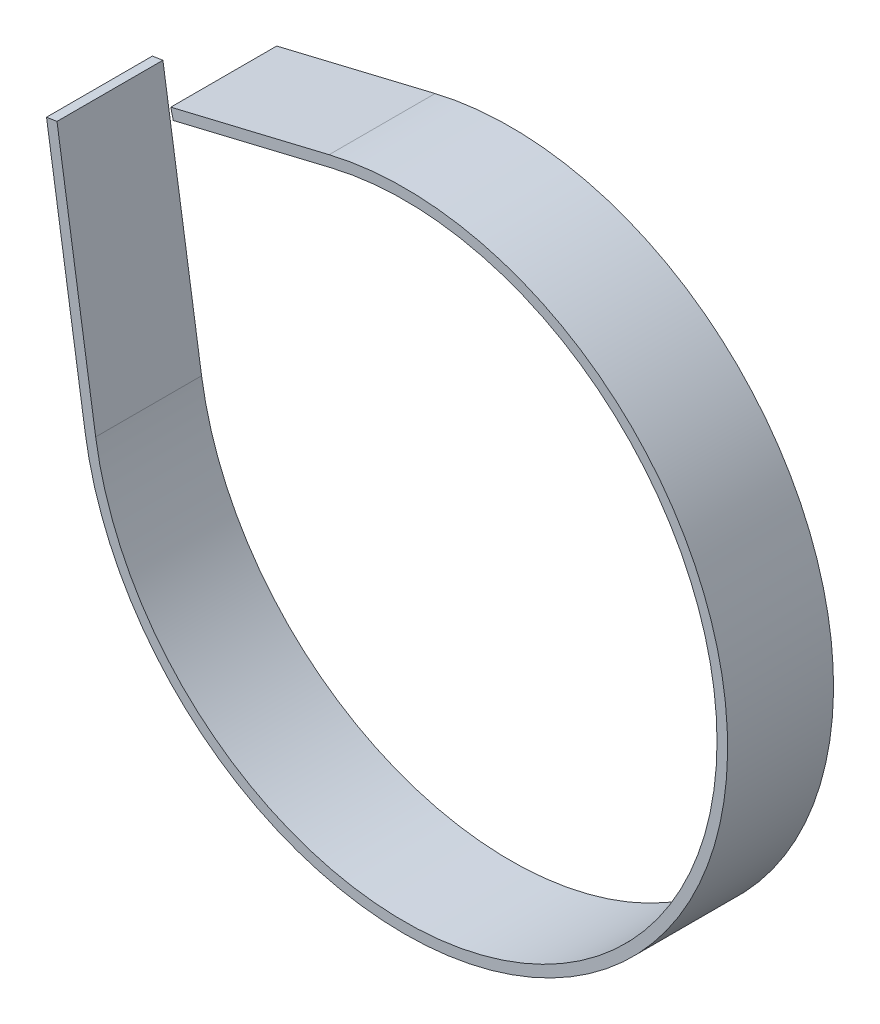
from build123d import *

# Parameters (mm, degrees)
EXTRUSION1_DEPTH = 80


with BuildPart() as part:
    # Esquisse1 → Extrusion1 (new body)
    with BuildSketch(Plane.XY):
        with BuildLine():
            Line((-233.309422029, -35.534681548), (-262.520134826, 156.253572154))
            Line((-262.520134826, 156.253572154), (-270.428928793, 155.049006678))
            Line((-270.428928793, 155.049006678), (-241.218215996, -36.739247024))
            ThreePointArc((-241.218215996, -36.739247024), (202.475480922, -136.160492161), (-56.960668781, 237.258260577))
            Line((-56.960668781, 237.258260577), (-176.56216899, 208.544480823))
            Line((-176.56216899, 208.544480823), (-174.694606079, 200.76552146))
            Line((-174.694606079, 200.76552146), (-55.09310587, 229.479301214))
            ThreePointArc((-55.09310587, 229.479301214), (195.836940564, -131.696213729), (-233.309422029, -35.534681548))
        make_face()
    extrude(amount=EXTRUSION1_DEPTH)


solid = part.part
